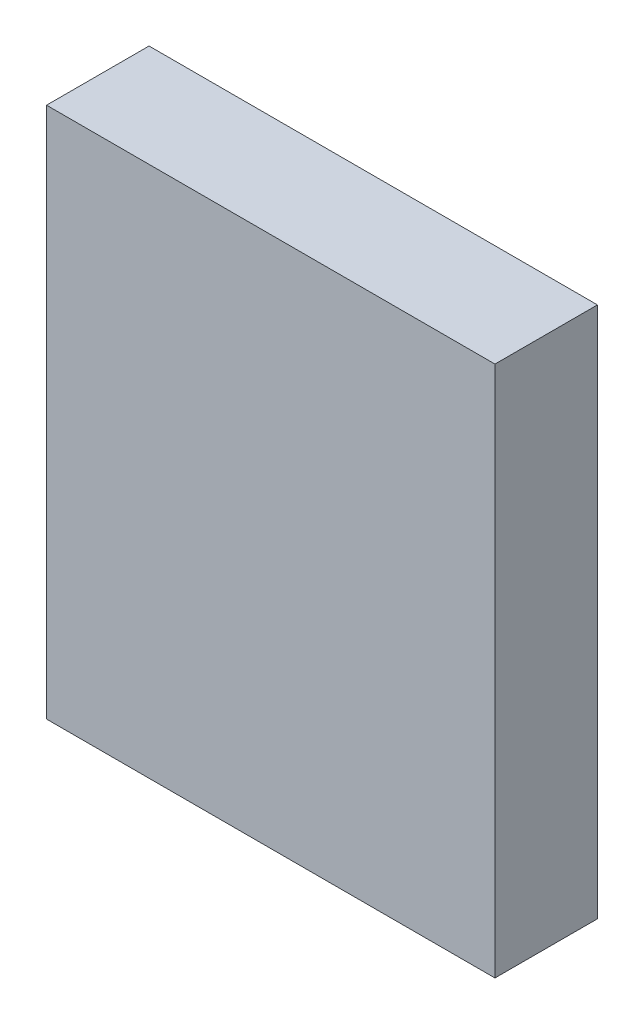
ISO-10303-21;
HEADER;
FILE_DESCRIPTION(('STEP AP214'),'2;1');
FILE_NAME('part.step','',(''),(''),'','','');
FILE_SCHEMA(('AUTOMOTIVE_DESIGN { 1 0 10303 214 1 1 1 1 }'));
ENDSEC;
DATA;
#1=APPLICATION_CONTEXT('core data for automotive mechanical design processes');
#2=APPLICATION_PROTOCOL_DEFINITION('international standard','automotive_design',2000,#1);
#3=PRODUCT_CONTEXT('',#1,'mechanical');
#4=PRODUCT('Part','Part','',(#3));
#5=PRODUCT_RELATED_PRODUCT_CATEGORY('part','',(#4));
#6=PRODUCT_DEFINITION_FORMATION('','',#4);
#7=PRODUCT_DEFINITION_CONTEXT('part definition',#1,'design');
#8=PRODUCT_DEFINITION('design','',#6,#7);
#9=PRODUCT_DEFINITION_SHAPE('','',#8);
#10=(LENGTH_UNIT() NAMED_UNIT(*) SI_UNIT(.MILLI.,.METRE.));
#11=(NAMED_UNIT(*) PLANE_ANGLE_UNIT() SI_UNIT($,.RADIAN.));
#12=(NAMED_UNIT(*) SI_UNIT($,.STERADIAN.) SOLID_ANGLE_UNIT());
#13=UNCERTAINTY_MEASURE_WITH_UNIT(LENGTH_MEASURE(1.E-05),#10,'distance_accuracy_value','');
#14=(GEOMETRIC_REPRESENTATION_CONTEXT(3) GLOBAL_UNCERTAINTY_ASSIGNED_CONTEXT((#13)) GLOBAL_UNIT_ASSIGNED_CONTEXT((#10,
#11,#12)) REPRESENTATION_CONTEXT('',''));
#15=CARTESIAN_POINT('',(0.,0.,0.));
#16=DIRECTION('',(0.,0.,1.));
#17=DIRECTION('',(1.,0.,0.));
#18=AXIS2_PLACEMENT_3D('',#15,#16,#17);
#19=CARTESIAN_POINT('',(0.,0.,8.));
#20=DIRECTION('',(1.,0.,0.));
#21=DIRECTION('',(0.,0.,-1.));
#22=AXIS2_PLACEMENT_3D('',#19,#20,#21);
#23=PLANE('',#22);
#24=DIRECTION('',(0.,-1.,0.));
#25=VECTOR('',#24,1.);
#26=CARTESIAN_POINT('',(0.,0.,0.));
#27=LINE('',#26,#25);
#28=CARTESIAN_POINT('',(0.,41.5,0.));
#29=VERTEX_POINT('',#28);
#30=CARTESIAN_POINT('',(0.,0.,0.));
#31=VERTEX_POINT('',#30);
#32=EDGE_CURVE('E94',#29,#31,#27,.T.);
#33=ORIENTED_EDGE('',*,*,#32,.T.);
#34=DIRECTION('',(0.,0.,-1.));
#35=VECTOR('',#34,1.);
#36=CARTESIAN_POINT('',(0.,0.,8.));
#37=LINE('',#36,#35);
#38=CARTESIAN_POINT('',(0.,0.,8.));
#39=VERTEX_POINT('',#38);
#40=EDGE_CURVE('E11',#39,#31,#37,.T.);
#41=ORIENTED_EDGE('',*,*,#40,.F.);
#42=DIRECTION('',(0.,-1.,0.));
#43=VECTOR('',#42,1.);
#44=CARTESIAN_POINT('',(0.,0.,8.));
#45=LINE('',#44,#43);
#46=CARTESIAN_POINT('',(0.,41.5,8.));
#47=VERTEX_POINT('',#46);
#48=EDGE_CURVE('E82',#47,#39,#45,.T.);
#49=ORIENTED_EDGE('',*,*,#48,.F.);
#50=DIRECTION('',(0.,0.,-1.));
#51=VECTOR('',#50,1.);
#52=CARTESIAN_POINT('',(0.,41.5,8.));
#53=LINE('',#52,#51);
#54=EDGE_CURVE('E90',#47,#29,#53,.T.);
#55=ORIENTED_EDGE('',*,*,#54,.T.);
#56=EDGE_LOOP('',(#33,#41,#49,#55));
#57=FACE_BOUND('',#56,.T.);
#58=ADVANCED_FACE('F31',(#57),#23,.F.);
#59=CARTESIAN_POINT('',(0.,0.,8.));
#60=DIRECTION('',(0.,1.,0.));
#61=DIRECTION('',(0.,0.,1.));
#62=AXIS2_PLACEMENT_3D('',#59,#60,#61);
#63=PLANE('',#62);
#64=DIRECTION('',(1.,0.,0.));
#65=VECTOR('',#64,1.);
#66=CARTESIAN_POINT('',(0.,0.,0.));
#67=LINE('',#66,#65);
#68=CARTESIAN_POINT('',(35.,0.,0.));
#69=VERTEX_POINT('',#68);
#70=EDGE_CURVE('E86',#31,#69,#67,.T.);
#71=ORIENTED_EDGE('',*,*,#70,.T.);
#72=DIRECTION('',(0.,0.,-1.));
#73=VECTOR('',#72,1.);
#74=CARTESIAN_POINT('',(35.,0.,8.));
#75=LINE('',#74,#73);
#76=CARTESIAN_POINT('',(35.,0.,8.));
#77=VERTEX_POINT('',#76);
#78=EDGE_CURVE('E39',#77,#69,#75,.T.);
#79=ORIENTED_EDGE('',*,*,#78,.F.);
#80=DIRECTION('',(1.,0.,0.));
#81=VECTOR('',#80,1.);
#82=CARTESIAN_POINT('',(0.,0.,8.));
#83=LINE('',#82,#81);
#84=EDGE_CURVE('E77',#39,#77,#83,.T.);
#85=ORIENTED_EDGE('',*,*,#84,.F.);
#86=ORIENTED_EDGE('',*,*,#40,.T.);
#87=EDGE_LOOP('',(#71,#79,#85,#86));
#88=FACE_BOUND('',#87,.T.);
#89=ADVANCED_FACE('F85',(#88),#63,.F.);
#90=CARTESIAN_POINT('',(35.,0.,8.));
#91=DIRECTION('',(-1.,0.,0.));
#92=DIRECTION('',(0.,0.,1.));
#93=AXIS2_PLACEMENT_3D('',#90,#91,#92);
#94=PLANE('',#93);
#95=DIRECTION('',(0.,1.,0.));
#96=VECTOR('',#95,1.);
#97=CARTESIAN_POINT('',(35.,0.,0.));
#98=LINE('',#97,#96);
#99=CARTESIAN_POINT('',(35.,41.5,0.));
#100=VERTEX_POINT('',#99);
#101=EDGE_CURVE('E64',#69,#100,#98,.T.);
#102=ORIENTED_EDGE('',*,*,#101,.T.);
#103=DIRECTION('',(0.,0.,-1.));
#104=VECTOR('',#103,1.);
#105=CARTESIAN_POINT('',(35.,41.5,8.));
#106=LINE('',#105,#104);
#107=CARTESIAN_POINT('',(35.,41.5,8.));
#108=VERTEX_POINT('',#107);
#109=EDGE_CURVE('E87',#108,#100,#106,.T.);
#110=ORIENTED_EDGE('',*,*,#109,.F.);
#111=DIRECTION('',(0.,1.,0.));
#112=VECTOR('',#111,1.);
#113=CARTESIAN_POINT('',(35.,0.,8.));
#114=LINE('',#113,#112);
#115=EDGE_CURVE('E80',#77,#108,#114,.T.);
#116=ORIENTED_EDGE('',*,*,#115,.F.);
#117=ORIENTED_EDGE('',*,*,#78,.T.);
#118=EDGE_LOOP('',(#102,#110,#116,#117));
#119=FACE_BOUND('',#118,.T.);
#120=ADVANCED_FACE('F88',(#119),#94,.F.);
#121=CARTESIAN_POINT('',(0.,41.5,8.));
#122=DIRECTION('',(0.,-1.,0.));
#123=DIRECTION('',(0.,0.,-1.));
#124=AXIS2_PLACEMENT_3D('',#121,#122,#123);
#125=PLANE('',#124);
#126=DIRECTION('',(-1.,0.,0.));
#127=VECTOR('',#126,1.);
#128=CARTESIAN_POINT('',(0.,41.5,0.));
#129=LINE('',#128,#127);
#130=EDGE_CURVE('E70',#100,#29,#129,.T.);
#131=ORIENTED_EDGE('',*,*,#130,.T.);
#132=ORIENTED_EDGE('',*,*,#54,.F.);
#133=DIRECTION('',(-1.,0.,0.));
#134=VECTOR('',#133,1.);
#135=CARTESIAN_POINT('',(0.,41.5,8.));
#136=LINE('',#135,#134);
#137=EDGE_CURVE('E47',#108,#47,#136,.T.);
#138=ORIENTED_EDGE('',*,*,#137,.F.);
#139=ORIENTED_EDGE('',*,*,#109,.T.);
#140=EDGE_LOOP('',(#131,#132,#138,#139));
#141=FACE_BOUND('',#140,.T.);
#142=ADVANCED_FACE('F101',(#141),#125,.F.);
#143=CARTESIAN_POINT('',(0.,41.5,8.));
#144=DIRECTION('',(0.,0.,-1.));
#145=DIRECTION('',(-1.,0.,0.));
#146=AXIS2_PLACEMENT_3D('',#143,#144,#145);
#147=PLANE('',#146);
#148=ORIENTED_EDGE('',*,*,#48,.T.);
#149=ORIENTED_EDGE('',*,*,#84,.T.);
#150=ORIENTED_EDGE('',*,*,#115,.T.);
#151=ORIENTED_EDGE('',*,*,#137,.T.);
#152=EDGE_LOOP('',(#148,#149,#150,#151));
#153=FACE_BOUND('',#152,.T.);
#154=ADVANCED_FACE('F78',(#153),#147,.F.);
#155=CARTESIAN_POINT('',(0.,41.5,0.));
#156=DIRECTION('',(0.,0.,-1.));
#157=DIRECTION('',(-1.,0.,0.));
#158=AXIS2_PLACEMENT_3D('',#155,#156,#157);
#159=PLANE('',#158);
#160=ORIENTED_EDGE('',*,*,#32,.F.);
#161=ORIENTED_EDGE('',*,*,#130,.F.);
#162=ORIENTED_EDGE('',*,*,#101,.F.);
#163=ORIENTED_EDGE('',*,*,#70,.F.);
#164=EDGE_LOOP('',(#160,#161,#162,#163));
#165=FACE_BOUND('',#164,.T.);
#166=ADVANCED_FACE('F104',(#165),#159,.T.);
#167=CLOSED_SHELL('',(#58,#89,#120,#142,#154,#166));
#168=MANIFOLD_SOLID_BREP('B2',#167);
#169=ADVANCED_BREP_SHAPE_REPRESENTATION('',(#18,#168),#14);
#170=SHAPE_DEFINITION_REPRESENTATION(#9,#169);
ENDSEC;
END-ISO-10303-21;
